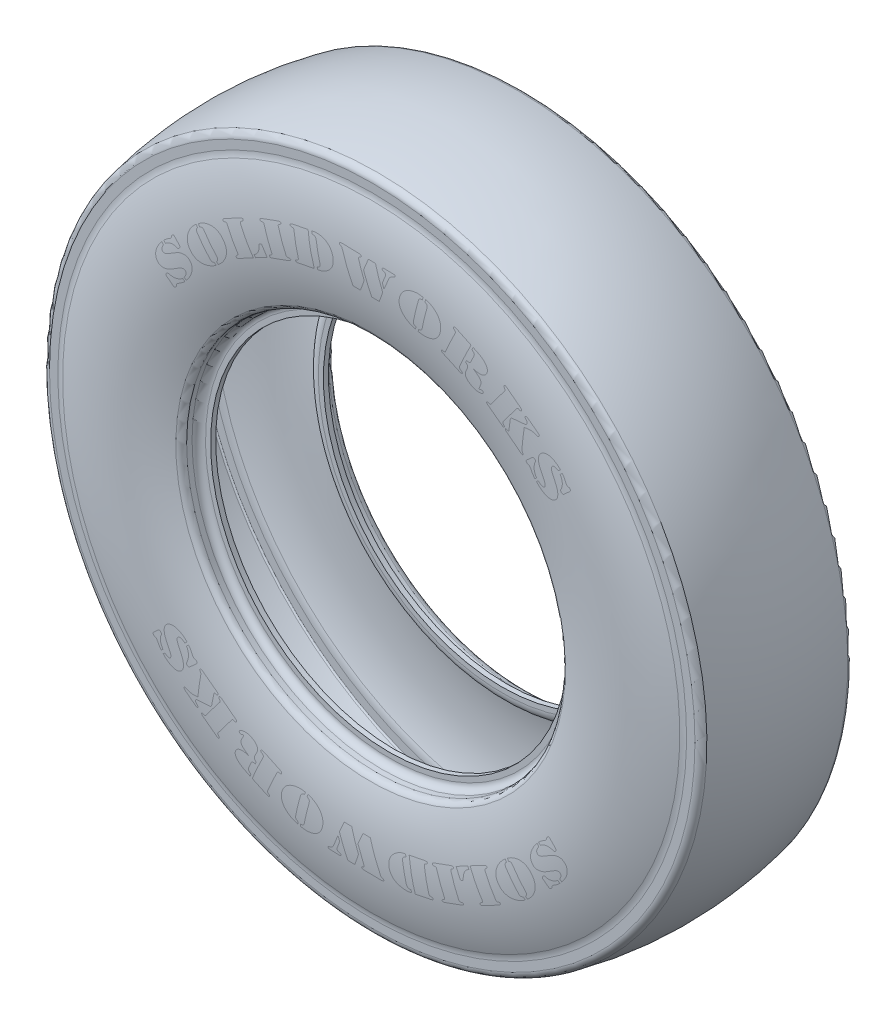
from build123d import *

# Parameters (mm, degrees)
CIRPATTERN2_COUNT = 2


with BuildPart() as part:
    # Sketch1 → Revolve-Thin1 (revolve)
    with BuildSketch(Plane(origin=(0, 0, 0), x_dir=(0, 0, -1), z_dir=(1, 0, 0))):
        with BuildLine():
            ThreePointArc((0, 200), (-21.035033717, 198.890742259), (-41.836734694, 195.575273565))
            ThreePointArc((-41.836734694, 195.575273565), (-44.110220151, 194.179027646), (-45, 191.663768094))
            Line((-45, 191.663768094), (-45, 186.684892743))
            ThreePointArc((-45, 186.684892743), (-45.152989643, 184.942369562), (-45.607277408, 183.25316398))
            ThreePointArc((-45.607277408, 183.25316398), (-51.678493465, 149.494089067), (-45.984544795, 115.669338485))
            ThreePointArc((-45.984544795, 115.669338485), (-44.522922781, 113.734831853), (-42.212365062, 113))
            Line((-42.212365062, 113), (-39, 113))
            ThreePointArc((-39, 113), (-36.171572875, 111.828427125), (-35, 109))
            Line((-35, 109), (-35, 106))
            Line((-35, 106), (-32, 106))
            Line((-32, 106), (-32, 109))
            ThreePointArc((-32, 109), (-34.050252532, 113.949747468), (-39, 116))
            Line((-39, 116), (-42.212365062, 116))
            ThreePointArc((-42.212365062, 116), (-42.790004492, 116.183707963), (-43.155409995, 116.667334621))
            ThreePointArc((-43.155409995, 116.667334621), (-48.678540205, 149.477342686), (-42.78946063, 182.223645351))
            ThreePointArc((-42.78946063, 182.223645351), (-42.198886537, 184.419612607), (-42, 186.684892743))
            Line((-42, 186.684892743), (-42, 191.663768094))
            ThreePointArc((-42, 191.663768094), (-41.777555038, 192.292582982), (-41.209183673, 192.641644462))
            ThreePointArc((-41.209183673, 192.641644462), (-20.719508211, 195.907381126), (0, 197))
            Line((0, 197), (0, 200))
        make_face()
    revolve_thin1 = revolve(axis=Axis((0, 0, 0), (0, 0, 1)))

    # Mirror1: part across plane


with BuildPart() as part_1:
    add(part.part)
    add(part.part.mirror(Plane(origin=(0, 200, 0), x_dir=(1, 0, 0), z_dir=(0, 0, 1))))


with BuildPart() as cirpattern2_1:
    # CirPattern2: Revolve-Thin1 ×2 about axis
    cirpattern2_axis = Axis((0, 0, 0), (0, 0, -1))
    for i in range(1, CIRPATTERN2_COUNT):
        add(revolve_thin1.rotate(cirpattern2_axis, i * 360 / CIRPATTERN2_COUNT))


with BuildPart() as part_2:
    add(part_1.part)

    # CirPattern2 united with what the copies: union CirPattern2_1
    add(cirpattern2_1.part)


solid = part_2.part
